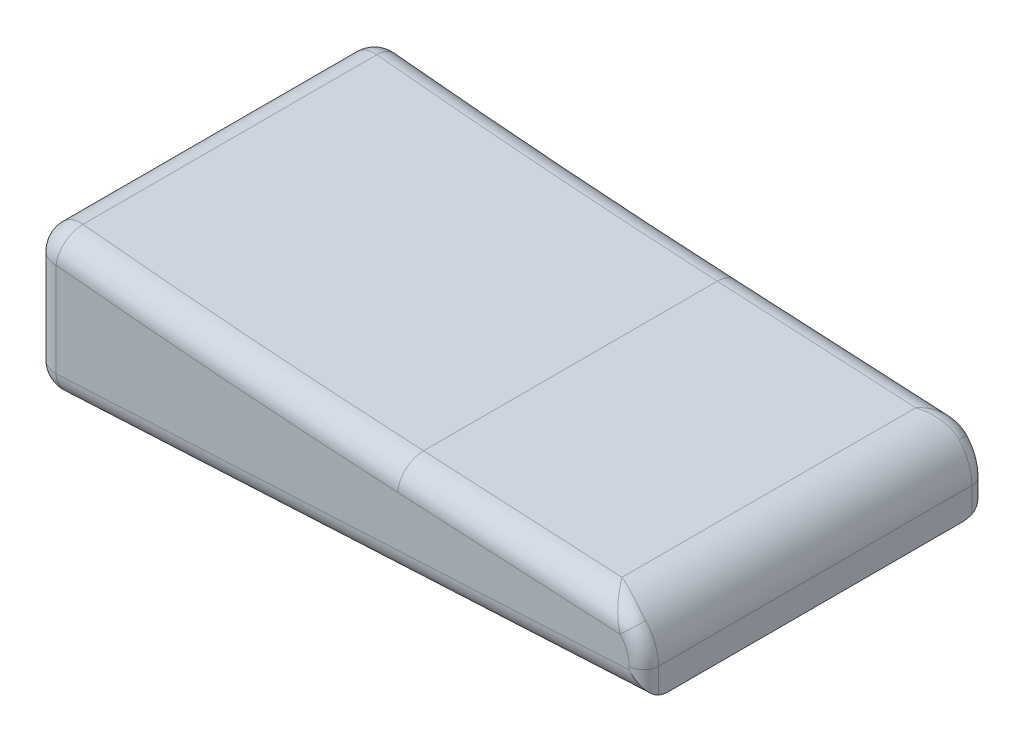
ISO-10303-21;
HEADER;
FILE_DESCRIPTION(('STEP AP214'),'2;1');
FILE_NAME('part.step','',(''),(''),'','','');
FILE_SCHEMA(('AUTOMOTIVE_DESIGN { 1 0 10303 214 1 1 1 1 }'));
ENDSEC;
DATA;
#1=APPLICATION_CONTEXT('core data for automotive mechanical design processes');
#2=APPLICATION_PROTOCOL_DEFINITION('international standard','automotive_design',2000,#1);
#3=PRODUCT_CONTEXT('',#1,'mechanical');
#4=PRODUCT('Part','Part','',(#3));
#5=PRODUCT_RELATED_PRODUCT_CATEGORY('part','',(#4));
#6=PRODUCT_DEFINITION_FORMATION('','',#4);
#7=PRODUCT_DEFINITION_CONTEXT('part definition',#1,'design');
#8=PRODUCT_DEFINITION('design','',#6,#7);
#9=PRODUCT_DEFINITION_SHAPE('','',#8);
#10=(LENGTH_UNIT() NAMED_UNIT(*) SI_UNIT(.MILLI.,.METRE.));
#11=(NAMED_UNIT(*) PLANE_ANGLE_UNIT() SI_UNIT($,.RADIAN.));
#12=(NAMED_UNIT(*) SI_UNIT($,.STERADIAN.) SOLID_ANGLE_UNIT());
#13=UNCERTAINTY_MEASURE_WITH_UNIT(LENGTH_MEASURE(1.E-05),#10,'distance_accuracy_value','');
#14=(GEOMETRIC_REPRESENTATION_CONTEXT(3) GLOBAL_UNCERTAINTY_ASSIGNED_CONTEXT((#13)) GLOBAL_UNIT_ASSIGNED_CONTEXT((#10,
#11,#12)) REPRESENTATION_CONTEXT('',''));
#15=CARTESIAN_POINT('',(0.,0.,0.));
#16=DIRECTION('',(0.,0.,1.));
#17=DIRECTION('',(1.,0.,0.));
#18=AXIS2_PLACEMENT_3D('',#15,#16,#17);
#19=CARTESIAN_POINT('',(0.,-7.5,35.));
#20=DIRECTION('',(-0.0523359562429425,0.998629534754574,0.));
#21=DIRECTION('',(-0.998629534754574,-0.0523359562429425,0.));
#22=AXIS2_PLACEMENT_3D('',#19,#20,#21);
#23=PLANE('',#22);
#24=DIRECTION('',(0.,0.,-1.));
#25=VECTOR('',#24,1.);
#26=CARTESIAN_POINT('',(-119.797416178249,-13.7783165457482,35.));
#27=LINE('',#26,#25);
#28=CARTESIAN_POINT('',(-119.797416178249,-13.7783165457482,30.));
#29=VERTEX_POINT('',#28);
#30=CARTESIAN_POINT('',(-119.797416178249,-13.7783165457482,-30.));
#31=VERTEX_POINT('',#30);
#32=EDGE_CURVE('E469',#29,#31,#27,.T.);
#33=ORIENTED_EDGE('',*,*,#32,.T.);
#34=DIRECTION('',(0.998629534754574,0.0523359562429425,0.));
#35=VECTOR('',#34,1.);
#36=CARTESIAN_POINT('',(0.,-7.5,-30.));
#37=LINE('',#36,#35);
#38=CARTESIAN_POINT('',(0.,-7.5,-30.));
#39=VERTEX_POINT('',#38);
#40=EDGE_CURVE('E359',#31,#39,#37,.T.);
#41=ORIENTED_EDGE('',*,*,#40,.T.);
#42=DIRECTION('',(0.,0.,-1.));
#43=VECTOR('',#42,1.);
#44=CARTESIAN_POINT('',(0.,-7.5,35.));
#45=LINE('',#44,#43);
#46=CARTESIAN_POINT('',(0.,-7.5,30.));
#47=VERTEX_POINT('',#46);
#48=EDGE_CURVE('E347',#47,#39,#45,.T.);
#49=ORIENTED_EDGE('',*,*,#48,.F.);
#50=DIRECTION('',(0.998629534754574,0.0523359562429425,0.));
#51=VECTOR('',#50,1.);
#52=CARTESIAN_POINT('',(0.,-7.5,30.));
#53=LINE('',#52,#51);
#54=EDGE_CURVE('E398',#47,#29,#53,.F.);
#55=ORIENTED_EDGE('',*,*,#54,.T.);
#56=EDGE_LOOP('',(#33,#41,#49,#55));
#57=FACE_BOUND('',#56,.T.);
#58=ADVANCED_FACE('F33',(#57),#23,.F.);
#59=CARTESIAN_POINT('',(0.,7.5,35.));
#60=DIRECTION('',(-1.,0.,0.));
#61=DIRECTION('',(0.,-1.,0.));
#62=AXIS2_PLACEMENT_3D('',#59,#60,#61);
#63=PLANE('',#62);
#64=ORIENTED_EDGE('',*,*,#48,.T.);
#65=CARTESIAN_POINT('',(0.,-2.4931382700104,-30.));
#66=DIRECTION('',(-1.,0.,0.));
#67=DIRECTION('',(0.,-1.,0.));
#68=AXIS2_PLACEMENT_3D('',#65,#66,#67);
#69=ELLIPSE('',#68,5.0068617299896,5.);
#70=CARTESIAN_POINT('',(0.,-7.08200284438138,-32.));
#71=VERTEX_POINT('',#70);
#72=EDGE_CURVE('E349',#39,#71,#69,.F.);
#73=ORIENTED_EDGE('',*,*,#72,.T.);
#74=DIRECTION('',(0.,1.,0.));
#75=VECTOR('',#74,1.);
#76=CARTESIAN_POINT('',(0.,7.5,-32.));
#77=LINE('',#76,#75);
#78=CARTESIAN_POINT('',(0.,-1.9896456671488,-32.));
#79=VERTEX_POINT('',#78);
#80=EDGE_CURVE('E363',#71,#79,#77,.T.);
#81=ORIENTED_EDGE('',*,*,#80,.T.);
#82=DIRECTION('',(0.,0.,-1.));
#83=VECTOR('',#82,1.);
#84=CARTESIAN_POINT('',(0.,-1.9896456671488,35.));
#85=LINE('',#84,#83);
#86=CARTESIAN_POINT('',(0.,-1.9896456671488,32.));
#87=VERTEX_POINT('',#86);
#88=EDGE_CURVE('E163',#79,#87,#85,.F.);
#89=ORIENTED_EDGE('',*,*,#88,.T.);
#90=DIRECTION('',(0.,1.,0.));
#91=VECTOR('',#90,1.);
#92=CARTESIAN_POINT('',(0.,7.5,32.));
#93=LINE('',#92,#91);
#94=CARTESIAN_POINT('',(0.,-7.08200284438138,32.));
#95=VERTEX_POINT('',#94);
#96=EDGE_CURVE('E442',#87,#95,#93,.F.);
#97=ORIENTED_EDGE('',*,*,#96,.T.);
#98=CARTESIAN_POINT('',(0.,-2.49313827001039,30.));
#99=DIRECTION('',(-1.,0.,0.));
#100=DIRECTION('',(0.,1.,0.));
#101=AXIS2_PLACEMENT_3D('',#98,#99,#100);
#102=ELLIPSE('',#101,5.0068617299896,5.);
#103=EDGE_CURVE('E352',#95,#47,#102,.F.);
#104=ORIENTED_EDGE('',*,*,#103,.T.);
#105=EDGE_LOOP('',(#64,#73,#81,#89,#97,#104));
#106=FACE_BOUND('',#105,.T.);
#107=ADVANCED_FACE('F337',(#106),#63,.F.);
#108=CARTESIAN_POINT('',(0.,7.5,35.));
#109=DIRECTION('',(-0.0523359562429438,-0.998629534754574,0.));
#110=DIRECTION('',(0.998629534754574,-0.0523359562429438,0.));
#111=AXIS2_PLACEMENT_3D('',#108,#109,#110);
#112=PLANE('',#111);
#113=DIRECTION('',(0.,0.,-1.));
#114=VECTOR('',#113,1.);
#115=CARTESIAN_POINT('',(-9.47664043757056,7.99664968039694,35.));
#116=LINE('',#115,#114);
#117=CARTESIAN_POINT('',(-9.47664043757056,7.99664968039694,30.));
#118=VERTEX_POINT('',#117);
#119=CARTESIAN_POINT('',(-9.47664043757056,7.99664968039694,-30.));
#120=VERTEX_POINT('',#119);
#121=EDGE_CURVE('E394',#118,#120,#116,.T.);
#122=ORIENTED_EDGE('',*,*,#121,.T.);
#123=DIRECTION('',(-0.998629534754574,0.0523359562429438,0.));
#124=VECTOR('',#123,1.);
#125=CARTESIAN_POINT('',(-50.,10.1203889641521,-30.));
#126=LINE('',#125,#124);
#127=CARTESIAN_POINT('',(-50.,10.1203889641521,-30.));
#128=VERTEX_POINT('',#127);
#129=EDGE_CURVE('E396',#120,#128,#126,.T.);
#130=ORIENTED_EDGE('',*,*,#129,.T.);
#131=DIRECTION('',(0.,0.,-1.));
#132=VECTOR('',#131,1.);
#133=CARTESIAN_POINT('',(-50.,10.1203889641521,35.));
#134=LINE('',#133,#132);
#135=CARTESIAN_POINT('',(-50.,10.1203889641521,30.));
#136=VERTEX_POINT('',#135);
#137=EDGE_CURVE('E354',#136,#128,#134,.T.);
#138=ORIENTED_EDGE('',*,*,#137,.F.);
#139=DIRECTION('',(-0.998629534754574,0.0523359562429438,0.));
#140=VECTOR('',#139,1.);
#141=CARTESIAN_POINT('',(0.,7.5,30.));
#142=LINE('',#141,#140);
#143=EDGE_CURVE('E392',#136,#118,#142,.F.);
#144=ORIENTED_EDGE('',*,*,#143,.T.);
#145=EDGE_LOOP('',(#122,#130,#138,#144));
#146=FACE_BOUND('',#145,.T.);
#147=ADVANCED_FACE('F335',(#146),#112,.F.);
#148=CARTESIAN_POINT('',(28.5039343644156,1508.06469109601,35.));
#149=DIRECTION('',(0.,0.,-1.));
#150=DIRECTION('',(-1.,0.,0.));
#151=AXIS2_PLACEMENT_3D('',#148,#149,#150);
#152=CYLINDRICAL_SURFACE('',#151,1500.);
#153=ORIENTED_EDGE('',*,*,#137,.T.);
#154=CARTESIAN_POINT('',(28.5039343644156,1508.06469109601,-30.));
#155=DIRECTION('',(0.,0.,-1.));
#156=DIRECTION('',(-1.,0.,0.));
#157=AXIS2_PLACEMENT_3D('',#154,#155,#156);
#158=CIRCLE('',#157,1500.);
#159=CARTESIAN_POINT('',(-119.565531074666,15.3907704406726,-30.));
#160=VERTEX_POINT('',#159);
#161=EDGE_CURVE('E12',#128,#160,#158,.T.);
#162=ORIENTED_EDGE('',*,*,#161,.T.);
#163=DIRECTION('',(0.,0.,-1.));
#164=VECTOR('',#163,1.);
#165=CARTESIAN_POINT('',(-119.565531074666,15.3907704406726,35.));
#166=LINE('',#165,#164);
#167=CARTESIAN_POINT('',(-119.565531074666,15.3907704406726,30.));
#168=VERTEX_POINT('',#167);
#169=EDGE_CURVE('E413',#168,#160,#166,.T.);
#170=ORIENTED_EDGE('',*,*,#169,.F.);
#171=CARTESIAN_POINT('',(28.5039343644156,1508.06469109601,30.));
#172=DIRECTION('',(0.,0.,-1.));
#173=DIRECTION('',(-1.,0.,0.));
#174=AXIS2_PLACEMENT_3D('',#171,#172,#173);
#175=CIRCLE('',#174,1500.);
#176=EDGE_CURVE('E40',#168,#136,#175,.F.);
#177=ORIENTED_EDGE('',*,*,#176,.T.);
#178=EDGE_LOOP('',(#153,#162,#170,#177));
#179=FACE_BOUND('',#178,.T.);
#180=ADVANCED_FACE('F332',(#179),#152,.F.);
#181=CARTESIAN_POINT('',(-120.059095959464,10.4151907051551,35.));
#182=DIRECTION('',(0.,0.,-1.));
#183=DIRECTION('',(-1.,0.,0.));
#184=AXIS2_PLACEMENT_3D('',#181,#182,#183);
#185=CYLINDRICAL_SURFACE('',#184,4.99999999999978);
#186=ORIENTED_EDGE('',*,*,#169,.T.);
#187=CARTESIAN_POINT('',(-120.059095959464,10.4151907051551,-30.));
#188=DIRECTION('',(0.,0.,-1.));
#189=DIRECTION('',(-1.,0.,0.));
#190=AXIS2_PLACEMENT_3D('',#187,#188,#189);
#191=CIRCLE('',#190,4.99999999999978);
#192=CARTESIAN_POINT('',(-125.059095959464,10.4151907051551,-30.));
#193=VERTEX_POINT('',#192);
#194=EDGE_CURVE('E410',#160,#193,#191,.F.);
#195=ORIENTED_EDGE('',*,*,#194,.T.);
#196=DIRECTION('',(0.,0.,-1.));
#197=VECTOR('',#196,1.);
#198=CARTESIAN_POINT('',(-125.059095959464,10.4151907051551,35.));
#199=LINE('',#198,#197);
#200=CARTESIAN_POINT('',(-125.059095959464,10.4151907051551,30.));
#201=VERTEX_POINT('',#200);
#202=EDGE_CURVE('E461',#201,#193,#199,.T.);
#203=ORIENTED_EDGE('',*,*,#202,.F.);
#204=CARTESIAN_POINT('',(-120.059095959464,10.4151907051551,30.));
#205=DIRECTION('',(0.,0.,-1.));
#206=DIRECTION('',(-1.,0.,0.));
#207=AXIS2_PLACEMENT_3D('',#204,#205,#206);
#208=CIRCLE('',#207,4.99999999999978);
#209=EDGE_CURVE('E52',#201,#168,#208,.T.);
#210=ORIENTED_EDGE('',*,*,#209,.T.);
#211=EDGE_LOOP('',(#186,#195,#203,#210));
#212=FACE_BOUND('',#211,.T.);
#213=ADVANCED_FACE('F328',(#212),#185,.T.);
#214=CARTESIAN_POINT('',(-125.059095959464,-8.7851688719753,35.));
#215=DIRECTION('',(1.,0.,0.));
#216=DIRECTION('',(0.,1.,0.));
#217=AXIS2_PLACEMENT_3D('',#214,#215,#216);
#218=PLANE('',#217);
#219=ORIENTED_EDGE('',*,*,#202,.T.);
#220=DIRECTION('',(0.,-1.,0.));
#221=VECTOR('',#220,1.);
#222=CARTESIAN_POINT('',(-125.059095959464,-8.7851688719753,-30.));
#223=LINE('',#222,#221);
#224=CARTESIAN_POINT('',(-125.059095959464,-8.7851688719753,-30.));
#225=VERTEX_POINT('',#224);
#226=EDGE_CURVE('E407',#193,#225,#223,.T.);
#227=ORIENTED_EDGE('',*,*,#226,.T.);
#228=DIRECTION('',(0.,0.,-1.));
#229=VECTOR('',#228,1.);
#230=CARTESIAN_POINT('',(-125.059095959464,-8.7851688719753,35.));
#231=LINE('',#230,#229);
#232=CARTESIAN_POINT('',(-125.059095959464,-8.7851688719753,30.));
#233=VERTEX_POINT('',#232);
#234=EDGE_CURVE('E466',#233,#225,#231,.T.);
#235=ORIENTED_EDGE('',*,*,#234,.F.);
#236=DIRECTION('',(0.,-1.,0.));
#237=VECTOR('',#236,1.);
#238=CARTESIAN_POINT('',(-125.059095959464,-8.7851688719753,30.));
#239=LINE('',#238,#237);
#240=EDGE_CURVE('E405',#233,#201,#239,.F.);
#241=ORIENTED_EDGE('',*,*,#240,.T.);
#242=EDGE_LOOP('',(#219,#227,#235,#241));
#243=FACE_BOUND('',#242,.T.);
#244=ADVANCED_FACE('F324',(#243),#218,.F.);
#245=CARTESIAN_POINT('',(-120.059095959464,-8.7851688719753,35.));
#246=DIRECTION('',(0.,0.,-1.));
#247=DIRECTION('',(-1.,0.,0.));
#248=AXIS2_PLACEMENT_3D('',#245,#246,#247);
#249=CYLINDRICAL_SURFACE('',#248,5.);
#250=ORIENTED_EDGE('',*,*,#234,.T.);
#251=CARTESIAN_POINT('',(-120.059095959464,-8.7851688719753,-30.));
#252=DIRECTION('',(0.,0.,-1.));
#253=DIRECTION('',(-1.,0.,0.));
#254=AXIS2_PLACEMENT_3D('',#251,#252,#253);
#255=CIRCLE('',#254,5.);
#256=EDGE_CURVE('E403',#225,#31,#255,.F.);
#257=ORIENTED_EDGE('',*,*,#256,.T.);
#258=ORIENTED_EDGE('',*,*,#32,.F.);
#259=CARTESIAN_POINT('',(-120.059095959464,-8.7851688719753,30.));
#260=DIRECTION('',(0.,0.,-1.));
#261=DIRECTION('',(-1.,0.,0.));
#262=AXIS2_PLACEMENT_3D('',#259,#260,#261);
#263=CIRCLE('',#262,5.);
#264=EDGE_CURVE('E401',#29,#233,#263,.T.);
#265=ORIENTED_EDGE('',*,*,#264,.T.);
#266=EDGE_LOOP('',(#250,#257,#258,#265));
#267=FACE_BOUND('',#266,.T.);
#268=ADVANCED_FACE('F320',(#267),#249,.T.);
#269=CARTESIAN_POINT('',(-120.059095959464,-8.7851688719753,35.));
#270=DIRECTION('',(0.,0.,-1.));
#271=DIRECTION('',(-1.,0.,0.));
#272=AXIS2_PLACEMENT_3D('',#269,#270,#271);
#273=PLANE('',#272);
#274=DIRECTION('',(0.998629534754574,0.0523359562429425,0.));
#275=VECTOR('',#274,1.);
#276=CARTESIAN_POINT('',(-120.059095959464,-8.7851688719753,35.));
#277=LINE('',#276,#275);
#278=CARTESIAN_POINT('',(-120.059095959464,-8.7851688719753,35.));
#279=VERTEX_POINT('',#278);
#280=CARTESIAN_POINT('',(-3.,-2.65036160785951,35.));
#281=VERTEX_POINT('',#280);
#282=EDGE_CURVE('E383',#279,#281,#277,.T.);
#283=ORIENTED_EDGE('',*,*,#282,.T.);
#284=DIRECTION('',(0.,1.,0.));
#285=VECTOR('',#284,1.);
#286=CARTESIAN_POINT('',(-3.,-8.78516887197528,35.));
#287=LINE('',#286,#285);
#288=CARTESIAN_POINT('',(-3.,-1.9896456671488,35.));
#289=VERTEX_POINT('',#288);
#290=EDGE_CURVE('E389',#281,#289,#287,.T.);
#291=ORIENTED_EDGE('',*,*,#290,.T.);
#292=CARTESIAN_POINT('',(-10.,-1.9896456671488,35.));
#293=DIRECTION('',(0.,0.,-1.));
#294=DIRECTION('',(-1.,0.,0.));
#295=AXIS2_PLACEMENT_3D('',#292,#293,#294);
#296=CIRCLE('',#295,7.);
#297=CARTESIAN_POINT('',(-4.84605461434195,2.74710923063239,35.));
#298=VERTEX_POINT('',#297);
#299=EDGE_CURVE('E387',#289,#298,#296,.F.);
#300=ORIENTED_EDGE('',*,*,#299,.T.);
#301=DIRECTION('',(-0.998629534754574,0.0523359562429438,0.));
#302=VECTOR('',#301,1.);
#303=CARTESIAN_POINT('',(-119.14079575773,8.73704279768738,35.));
#304=LINE('',#303,#302);
#305=CARTESIAN_POINT('',(-50.2616797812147,5.12724129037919,35.));
#306=VERTEX_POINT('',#305);
#307=EDGE_CURVE('E385',#298,#306,#304,.T.);
#308=ORIENTED_EDGE('',*,*,#307,.T.);
#309=CARTESIAN_POINT('',(28.5039343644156,1508.06469109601,35.));
#310=DIRECTION('',(0.,0.,-1.));
#311=DIRECTION('',(-1.,0.,0.));
#312=AXIS2_PLACEMENT_3D('',#309,#310,#311);
#313=CIRCLE('',#312,1505.);
#314=CARTESIAN_POINT('',(-120.059095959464,10.4151907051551,35.));
#315=VERTEX_POINT('',#314);
#316=EDGE_CURVE('E379',#306,#315,#313,.T.);
#317=ORIENTED_EDGE('',*,*,#316,.T.);
#318=DIRECTION('',(0.,-1.,0.));
#319=VECTOR('',#318,1.);
#320=CARTESIAN_POINT('',(-120.059095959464,-8.7851688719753,35.));
#321=LINE('',#320,#319);
#322=EDGE_CURVE('E381',#315,#279,#321,.T.);
#323=ORIENTED_EDGE('',*,*,#322,.T.);
#324=EDGE_LOOP('',(#283,#291,#300,#308,#317,#323));
#325=FACE_BOUND('',#324,.T.);
#326=ADVANCED_FACE('F316',(#325),#273,.F.);
#327=CARTESIAN_POINT('',(-120.059095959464,-8.7851688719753,-35.));
#328=DIRECTION('',(0.,0.,-1.));
#329=DIRECTION('',(-1.,0.,0.));
#330=AXIS2_PLACEMENT_3D('',#327,#328,#329);
#331=PLANE('',#330);
#332=DIRECTION('',(-0.998629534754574,0.0523359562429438,0.));
#333=VECTOR('',#332,1.);
#334=CARTESIAN_POINT('',(-0.26167978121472,2.50685232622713,-35.));
#335=LINE('',#334,#333);
#336=CARTESIAN_POINT('',(-50.2616797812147,5.12724129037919,-35.));
#337=VERTEX_POINT('',#336);
#338=CARTESIAN_POINT('',(-4.84605461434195,2.74710923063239,-35.));
#339=VERTEX_POINT('',#338);
#340=EDGE_CURVE('E373',#337,#339,#335,.F.);
#341=ORIENTED_EDGE('',*,*,#340,.T.);
#342=CARTESIAN_POINT('',(-10.,-1.9896456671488,-35.));
#343=DIRECTION('',(0.,0.,-1.));
#344=DIRECTION('',(-1.,0.,0.));
#345=AXIS2_PLACEMENT_3D('',#342,#343,#344);
#346=CIRCLE('',#345,7.);
#347=CARTESIAN_POINT('',(-3.,-1.9896456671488,-35.));
#348=VERTEX_POINT('',#347);
#349=EDGE_CURVE('E170',#339,#348,#346,.T.);
#350=ORIENTED_EDGE('',*,*,#349,.T.);
#351=DIRECTION('',(0.,1.,0.));
#352=VECTOR('',#351,1.);
#353=CARTESIAN_POINT('',(-3.,-7.5,-35.));
#354=LINE('',#353,#352);
#355=CARTESIAN_POINT('',(-3.,-2.65036160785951,-35.));
#356=VERTEX_POINT('',#355);
#357=EDGE_CURVE('E375',#348,#356,#354,.F.);
#358=ORIENTED_EDGE('',*,*,#357,.T.);
#359=DIRECTION('',(0.998629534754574,0.0523359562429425,0.));
#360=VECTOR('',#359,1.);
#361=CARTESIAN_POINT('',(-120.059095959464,-8.7851688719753,-35.));
#362=LINE('',#361,#360);
#363=CARTESIAN_POINT('',(-120.059095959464,-8.7851688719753,-35.));
#364=VERTEX_POINT('',#363);
#365=EDGE_CURVE('E371',#356,#364,#362,.F.);
#366=ORIENTED_EDGE('',*,*,#365,.T.);
#367=DIRECTION('',(0.,-1.,0.));
#368=VECTOR('',#367,1.);
#369=CARTESIAN_POINT('',(-120.059095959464,10.4151907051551,-35.));
#370=LINE('',#369,#368);
#371=CARTESIAN_POINT('',(-120.059095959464,10.4151907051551,-35.));
#372=VERTEX_POINT('',#371);
#373=EDGE_CURVE('E365',#364,#372,#370,.F.);
#374=ORIENTED_EDGE('',*,*,#373,.T.);
#375=CARTESIAN_POINT('',(28.5039343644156,1508.06469109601,-35.));
#376=DIRECTION('',(0.,0.,-1.));
#377=DIRECTION('',(-1.,0.,0.));
#378=AXIS2_PLACEMENT_3D('',#375,#376,#377);
#379=CIRCLE('',#378,1505.);
#380=EDGE_CURVE('E362',#372,#337,#379,.F.);
#381=ORIENTED_EDGE('',*,*,#380,.T.);
#382=EDGE_LOOP('',(#341,#350,#358,#366,#374,#381));
#383=FACE_BOUND('',#382,.T.);
#384=ADVANCED_FACE('F312',(#383),#331,.T.);
#385=CARTESIAN_POINT('',(-120.059095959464,-8.7851688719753,30.));
#386=DIRECTION('',(0.,-1.,0.));
#387=DIRECTION('',(1.,0.,0.));
#388=AXIS2_PLACEMENT_3D('',#385,#386,#387);
#389=CYLINDRICAL_SURFACE('',#388,5.);
#390=CARTESIAN_POINT('',(-120.059095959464,10.4151907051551,30.));
#391=DIRECTION('',(0.,1.,0.));
#392=DIRECTION('',(-1.,0.,0.));
#393=AXIS2_PLACEMENT_3D('',#390,#391,#392);
#394=CIRCLE('',#393,5.);
#395=EDGE_CURVE('E477',#201,#315,#394,.T.);
#396=ORIENTED_EDGE('',*,*,#395,.F.);
#397=ORIENTED_EDGE('',*,*,#240,.F.);
#398=CARTESIAN_POINT('',(-120.059095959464,-8.7851688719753,30.));
#399=DIRECTION('',(0.,-1.,0.));
#400=DIRECTION('',(0.,0.,-1.));
#401=AXIS2_PLACEMENT_3D('',#398,#399,#400);
#402=CIRCLE('',#401,5.);
#403=EDGE_CURVE('E474',#279,#233,#402,.T.);
#404=ORIENTED_EDGE('',*,*,#403,.F.);
#405=ORIENTED_EDGE('',*,*,#322,.F.);
#406=EDGE_LOOP('',(#396,#397,#404,#405));
#407=FACE_BOUND('',#406,.T.);
#408=ADVANCED_FACE('F308',(#407),#389,.T.);
#409=CARTESIAN_POINT('',(-120.059095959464,-8.7851688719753,30.));
#410=DIRECTION('',(0.,0.,1.));
#411=DIRECTION('',(1.,0.,0.));
#412=AXIS2_PLACEMENT_3D('',#409,#410,#411);
#413=SPHERICAL_SURFACE('',#412,5.);
#414=ORIENTED_EDGE('',*,*,#403,.T.);
#415=ORIENTED_EDGE('',*,*,#264,.F.);
#416=CARTESIAN_POINT('',(-120.059095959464,-8.7851688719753,30.));
#417=DIRECTION('',(0.998629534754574,0.0523359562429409,0.));
#418=DIRECTION('',(-0.0523359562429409,0.998629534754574,0.));
#419=AXIS2_PLACEMENT_3D('',#416,#417,#418);
#420=CIRCLE('',#419,5.);
#421=EDGE_CURVE('E479',#279,#29,#420,.T.);
#422=ORIENTED_EDGE('',*,*,#421,.F.);
#423=EDGE_LOOP('',(#414,#415,#422));
#424=FACE_BOUND('',#423,.T.);
#425=ADVANCED_FACE('F304',(#424),#413,.T.);
#426=CARTESIAN_POINT('',(-120.059095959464,10.4151907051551,30.));
#427=DIRECTION('',(0.,0.,1.));
#428=DIRECTION('',(1.,0.,0.));
#429=AXIS2_PLACEMENT_3D('',#426,#427,#428);
#430=SPHERICAL_SURFACE('',#429,5.);
#431=ORIENTED_EDGE('',*,*,#209,.F.);
#432=ORIENTED_EDGE('',*,*,#395,.T.);
#433=CARTESIAN_POINT('',(-120.059095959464,10.4151907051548,30.));
#434=DIRECTION('',(0.995115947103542,-0.0987129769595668,0.));
#435=DIRECTION('',(0.0987129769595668,0.995115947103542,0.));
#436=AXIS2_PLACEMENT_3D('',#433,#434,#435);
#437=CIRCLE('',#436,5.);
#438=EDGE_CURVE('E283',#168,#315,#437,.T.);
#439=ORIENTED_EDGE('',*,*,#438,.F.);
#440=EDGE_LOOP('',(#431,#432,#439));
#441=FACE_BOUND('',#440,.T.);
#442=ADVANCED_FACE('F301',(#441),#430,.T.);
#443=CARTESIAN_POINT('',(-120.059095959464,-8.7851688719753,30.));
#444=DIRECTION('',(0.998629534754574,0.0523359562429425,0.));
#445=DIRECTION('',(-0.0523359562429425,0.998629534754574,0.));
#446=AXIS2_PLACEMENT_3D('',#443,#444,#445);
#447=CYLINDRICAL_SURFACE('',#446,5.);
#448=ORIENTED_EDGE('',*,*,#54,.F.);
#449=ORIENTED_EDGE('',*,*,#103,.F.);
#450=CARTESIAN_POINT('',(0.,-7.08200284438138,32.));
#451=CARTESIAN_POINT('',(1.07206284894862E-05,-7.04283874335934,32.0896685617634));
#452=CARTESIAN_POINT('',(-0.00401847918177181,-7.00120053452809,32.1781946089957));
#453=CARTESIAN_POINT('',(-0.0194688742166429,-6.91345635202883,32.3521794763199));
#454=CARTESIAN_POINT('',(-0.0308788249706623,-6.86735726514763,32.4376427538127));
#455=CARTESIAN_POINT('',(-0.0602645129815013,-6.77151482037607,32.6041890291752));
#456=CARTESIAN_POINT('',(-0.0781758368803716,-6.7218109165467,32.6853063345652));
#457=CARTESIAN_POINT('',(-0.119905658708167,-6.6187794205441,32.8436611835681));
#458=CARTESIAN_POINT('',(-0.143726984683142,-6.565450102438,32.9208968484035));
#459=CARTESIAN_POINT('',(-0.203092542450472,-6.44215130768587,33.0895582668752));
#460=CARTESIAN_POINT('',(-0.240078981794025,-6.3713015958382,33.1798357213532));
#461=CARTESIAN_POINT('',(-0.321024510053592,-6.22536758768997,33.3536213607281));
#462=CARTESIAN_POINT('',(-0.364988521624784,-6.1502803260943,33.4371247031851));
#463=CARTESIAN_POINT('',(-0.506113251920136,-5.91908002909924,33.6778607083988));
#464=CARTESIAN_POINT('',(-0.612280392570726,-5.75747846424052,33.8247130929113));
#465=CARTESIAN_POINT('',(-0.805080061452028,-5.47723281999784,34.0485915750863));
#466=CARTESIAN_POINT('',(-0.88725104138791,-5.36119220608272,34.1330026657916));
#467=CARTESIAN_POINT('',(-1.0578970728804,-5.12535308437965,34.2894600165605));
#468=CARTESIAN_POINT('',(-1.14637441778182,-5.00555321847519,34.3615017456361));
#469=CARTESIAN_POINT('',(-1.32824412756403,-4.76305297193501,34.4935662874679));
#470=CARTESIAN_POINT('',(-1.42163845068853,-4.64035144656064,34.5535842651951));
#471=CARTESIAN_POINT('',(-1.61216437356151,-4.39279193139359,34.6619381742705));
#472=CARTESIAN_POINT('',(-1.70929541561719,-4.26793426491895,34.7102758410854));
#473=CARTESIAN_POINT('',(-1.99842642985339,-3.89916727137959,34.8354934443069));
#474=CARTESIAN_POINT('',(-2.19432989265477,-3.65294609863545,34.8968847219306));
#475=CARTESIAN_POINT('',(-2.59059234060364,-3.15819439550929,34.9787927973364));
#476=CARTESIAN_POINT('',(-2.7909411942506,-2.90966974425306,34.9993944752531));
#477=CARTESIAN_POINT('',(-2.99407749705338,-2.65770763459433,34.9999956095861));
#478=CARTESIAN_POINT('',(-2.99703877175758,-2.65403459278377,34.9999999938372));
#479=CARTESIAN_POINT('',(-3.,-2.65036160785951,35.));
#480=B_SPLINE_CURVE_WITH_KNOTS('',3,(#450,#451,#452,#453,#454,#455,#456,#457,#458,#459,#460,
#461,#462,#463,#464,#465,#466,#467,#468,#469,#470,#471,#472,#473,#474,#475,#476,#477,#478,#479),
.UNSPECIFIED.,.F.,.F.,(4,2,2,2,2,2,2,2,2,2,2,2,2,2,4),(0.,0.293341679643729,0.586237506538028,
0.876307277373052,1.16651612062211,1.52768851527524,1.889116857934,2.61430913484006,
3.10983736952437,3.60554673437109,4.10145503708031,4.59728961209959,5.55606891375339,
6.5128509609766,6.52700523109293),.UNSPECIFIED.);
#481=EDGE_CURVE('E275',#281,#95,#480,.F.);
#482=ORIENTED_EDGE('',*,*,#481,.F.);
#483=ORIENTED_EDGE('',*,*,#282,.F.);
#484=ORIENTED_EDGE('',*,*,#421,.T.);
#485=EDGE_LOOP('',(#448,#449,#482,#483,#484));
#486=FACE_BOUND('',#485,.T.);
#487=ADVANCED_FACE('F285',(#486),#447,.T.);
#488=CARTESIAN_POINT('',(28.5039343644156,1508.06469109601,30.));
#489=DIRECTION('',(0.,0.,-1.));
#490=DIRECTION('',(-1.,0.,0.));
#491=AXIS2_PLACEMENT_3D('',#488,#489,#490);
#492=TOROIDAL_SURFACE('',#491,1505.,5.);
#493=ORIENTED_EDGE('',*,*,#438,.T.);
#494=ORIENTED_EDGE('',*,*,#316,.F.);
#495=CARTESIAN_POINT('',(-50.2616797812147,5.12724129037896,30.));
#496=DIRECTION('',(0.998629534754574,-0.0523359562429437,0.));
#497=DIRECTION('',(0.0523359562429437,0.998629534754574,0.));
#498=AXIS2_PLACEMENT_3D('',#495,#496,#497);
#499=CIRCLE('',#498,5.);
#500=EDGE_CURVE('E272',#136,#306,#499,.T.);
#501=ORIENTED_EDGE('',*,*,#500,.F.);
#502=ORIENTED_EDGE('',*,*,#176,.F.);
#503=EDGE_LOOP('',(#493,#494,#501,#502));
#504=FACE_BOUND('',#503,.T.);
#505=ADVANCED_FACE('F296',(#504),#492,.T.);
#506=CARTESIAN_POINT('',(-120.059095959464,10.4151907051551,-30.));
#507=DIRECTION('',(0.,0.,1.));
#508=DIRECTION('',(1.,0.,0.));
#509=AXIS2_PLACEMENT_3D('',#506,#507,#508);
#510=SPHERICAL_SURFACE('',#509,5.);
#511=CARTESIAN_POINT('',(-120.059095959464,10.4151907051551,-30.));
#512=DIRECTION('',(0.,-1.,0.));
#513=DIRECTION('',(0.,0.,-1.));
#514=AXIS2_PLACEMENT_3D('',#511,#512,#513);
#515=CIRCLE('',#514,5.);
#516=EDGE_CURVE('E266',#193,#372,#515,.T.);
#517=ORIENTED_EDGE('',*,*,#516,.F.);
#518=ORIENTED_EDGE('',*,*,#194,.F.);
#519=CARTESIAN_POINT('',(-120.059095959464,10.4151907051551,-30.));
#520=DIRECTION('',(0.995115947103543,-0.0987129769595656,0.));
#521=DIRECTION('',(0.0987129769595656,0.995115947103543,0.));
#522=AXIS2_PLACEMENT_3D('',#519,#520,#521);
#523=CIRCLE('',#522,5.);
#524=EDGE_CURVE('E269',#372,#160,#523,.T.);
#525=ORIENTED_EDGE('',*,*,#524,.F.);
#526=EDGE_LOOP('',(#517,#518,#525));
#527=FACE_BOUND('',#526,.T.);
#528=ADVANCED_FACE('F292',(#527),#510,.T.);
#529=CARTESIAN_POINT('',(-3.,-8.78516887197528,32.));
#530=DIRECTION('',(0.,1.,0.));
#531=DIRECTION('',(-1.,0.,0.));
#532=AXIS2_PLACEMENT_3D('',#529,#530,#531);
#533=CYLINDRICAL_SURFACE('',#532,3.);
#534=ORIENTED_EDGE('',*,*,#481,.T.);
#535=ORIENTED_EDGE('',*,*,#96,.F.);
#536=CARTESIAN_POINT('',(-3.,-1.9896456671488,32.));
#537=DIRECTION('',(0.,1.,0.));
#538=DIRECTION('',(-1.,0.,0.));
#539=AXIS2_PLACEMENT_3D('',#536,#537,#538);
#540=CIRCLE('',#539,3.);
#541=EDGE_CURVE('E263',#289,#87,#540,.T.);
#542=ORIENTED_EDGE('',*,*,#541,.F.);
#543=ORIENTED_EDGE('',*,*,#290,.F.);
#544=EDGE_LOOP('',(#534,#535,#542,#543));
#545=FACE_BOUND('',#544,.T.);
#546=ADVANCED_FACE('F288',(#545),#533,.T.);
#547=CARTESIAN_POINT('',(-119.14079575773,8.73704279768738,30.));
#548=DIRECTION('',(-0.998629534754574,0.0523359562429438,0.));
#549=DIRECTION('',(-0.0523359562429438,-0.998629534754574,0.));
#550=AXIS2_PLACEMENT_3D('',#547,#548,#549);
#551=CYLINDRICAL_SURFACE('',#550,5.);
#552=ORIENTED_EDGE('',*,*,#500,.T.);
#553=ORIENTED_EDGE('',*,*,#307,.F.);
#554=CARTESIAN_POINT('',(-9.47664043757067,7.99664968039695,30.));
#555=CARTESIAN_POINT('',(-9.47664043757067,7.99664968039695,30.));
#556=CARTESIAN_POINT('',(-9.47664043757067,7.99664968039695,30.));
#557=CARTESIAN_POINT('',(-9.47172813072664,7.99639222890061,30.0065733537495));
#558=CARTESIAN_POINT('',(-9.47067549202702,7.99633707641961,30.0046013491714));
#559=CARTESIAN_POINT('',(-9.46962285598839,7.99628189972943,30.0026293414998));
#560=CARTESIAN_POINT('',(-9.46681644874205,7.99612183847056,30.013146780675));
#561=CARTESIAN_POINT('',(-9.46471074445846,7.9960192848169,30.009202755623));
#562=CARTESIAN_POINT('',(-9.46260558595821,7.9959067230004,30.00525871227));
#563=CARTESIAN_POINT('',(-9.2467116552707,7.9834234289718,30.3077580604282));
#564=CARTESIAN_POINT('',(-9.197371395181,7.98154292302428,30.2154466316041));
#565=CARTESIAN_POINT('',(-9.14811805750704,7.97876044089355,30.1231032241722));
#566=CARTESIAN_POINT('',(-9.03272832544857,7.94616165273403,30.5958692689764));
#567=CARTESIAN_POINT('',(-8.93555959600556,7.95736792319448,30.4178265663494));
#568=CARTESIAN_POINT('',(-8.84126071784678,7.94779450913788,30.2383477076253));
#569=CARTESIAN_POINT('',(-8.60793576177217,7.82159138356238,31.166600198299));
#570=CARTESIAN_POINT('',(-8.41257952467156,7.88875934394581,30.8225915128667));
#571=CARTESIAN_POINT('',(-8.2298310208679,7.857289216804,30.4666400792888));
#572=CARTESIAN_POINT('',(-8.39712938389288,7.73424032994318,31.4492150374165));
#573=CARTESIAN_POINT('',(-8.14971763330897,7.84395086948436,31.0262910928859));
#574=CARTESIAN_POINT('',(-7.92526083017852,7.79772556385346,30.5796860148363));
#575=CARTESIAN_POINT('',(-7.97931298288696,7.5083344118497,32.0031273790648));
#576=CARTESIAN_POINT('',(-7.6223443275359,7.73242431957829,31.435072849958));
#577=CARTESIAN_POINT('',(-7.31924107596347,7.64938879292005,30.8012509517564));
#578=CARTESIAN_POINT('',(-7.77230896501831,7.3697048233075,32.2744077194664));
#579=CARTESIAN_POINT('',(-7.35605743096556,7.66500817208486,31.641532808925));
#580=CARTESIAN_POINT('',(-7.01779672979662,7.56057306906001,30.909763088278));
#581=CARTESIAN_POINT('',(-7.36354544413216,7.03973804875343,32.7978998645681));
#582=CARTESIAN_POINT('',(-6.81983322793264,7.50512569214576,32.0566813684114));
#583=CARTESIAN_POINT('',(-6.42002669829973,7.35293419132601,31.1191599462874));
#584=CARTESIAN_POINT('',(-7.16178201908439,6.8484415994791,33.05012621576));
#585=CARTESIAN_POINT('',(-6.54796754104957,7.41160521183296,32.2668509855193));
#586=CARTESIAN_POINT('',(-6.12369724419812,7.23413423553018,31.2200504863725));
#587=CARTESIAN_POINT('',(-6.845199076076,6.49971916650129,33.4300241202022));
#588=CARTESIAN_POINT('',(-6.11112288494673,7.23879021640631,32.6028473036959));
#589=CARTESIAN_POINT('',(-5.65655712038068,7.01986330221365,31.3720096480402));
#590=CARTESIAN_POINT('',(-6.72825808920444,6.35994761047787,33.566772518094));
#591=CARTESIAN_POINT('',(-5.94537264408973,7.16803213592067,32.7299389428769));
#592=CARTESIAN_POINT('',(-5.48351164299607,6.93442697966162,31.4267090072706));
#593=CARTESIAN_POINT('',(-6.4970549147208,6.06057500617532,33.827924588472));
#594=CARTESIAN_POINT('',(-5.61003088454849,7.01332825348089,32.9856640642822));
#595=CARTESIAN_POINT('',(-5.14035293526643,6.75229664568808,31.5311698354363));
#596=CARTESIAN_POINT('',(-6.38279202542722,5.90097922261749,33.9523315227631));
#597=CARTESIAN_POINT('',(-5.43994647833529,6.92893012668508,33.114646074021));
#598=CARTESIAN_POINT('',(-4.97023894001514,6.65560562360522,31.5809326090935));
#599=CARTESIAN_POINT('',(-6.15744659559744,5.56161412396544,34.1858931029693));
#600=CARTESIAN_POINT('',(-5.0948261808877,6.74417059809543,33.3739636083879));
#601=CARTESIAN_POINT('',(-4.63364310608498,6.45079095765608,31.6743572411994));
#602=CARTESIAN_POINT('',(-6.04636179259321,5.38185963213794,34.2950588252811));
#603=CARTESIAN_POINT('',(-4.91925194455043,6.64322256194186,33.5046505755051));
#604=CARTESIAN_POINT('',(-4.46715870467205,6.34267571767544,31.7180235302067));
#605=CARTESIAN_POINT('',(-5.82791120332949,5.00195016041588,34.4946878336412));
#606=CARTESIAN_POINT('',(-4.56170034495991,6.42140572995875,33.7666778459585));
#607=CARTESIAN_POINT('',(-4.13858015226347,6.11490652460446,31.797875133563));
#608=CARTESIAN_POINT('',(-5.72054434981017,4.80180110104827,34.5851565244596));
#609=CARTESIAN_POINT('',(-4.37913937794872,6.29975660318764,33.8983399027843));
#610=CARTESIAN_POINT('',(-3.97648474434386,5.99525592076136,31.8340626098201));
#611=CARTESIAN_POINT('',(-5.46201955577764,4.28462214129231,34.7794067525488));
#612=CARTESIAN_POINT('',(-3.91742083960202,5.96728577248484,34.2229698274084));
#613=CARTESIAN_POINT('',(-3.5846020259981,5.68692950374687,31.9117627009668));
#614=CARTESIAN_POINT('',(-5.31324582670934,3.95594616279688,34.8704120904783));
#615=CARTESIAN_POINT('',(-3.63497136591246,5.74152677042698,34.4140173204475));
#616=CARTESIAN_POINT('',(-3.35769341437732,5.49167825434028,31.9481648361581));
#617=CARTESIAN_POINT('',(-5.09963502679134,3.43338595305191,34.9576111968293));
#618=CARTESIAN_POINT('',(-3.20193983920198,5.3508231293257,34.684257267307));
#619=CARTESIAN_POINT('',(-3.02962702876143,5.18227625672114,31.9830444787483));
#620=CARTESIAN_POINT('',(-5.03013902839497,3.25462126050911,34.9784659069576));
#621=CARTESIAN_POINT('',(-3.05333208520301,5.20898330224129,34.7730551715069));
#622=CARTESIAN_POINT('',(-2.92250190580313,5.07659203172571,31.9913863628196));
#623=CARTESIAN_POINT('',(-4.89464721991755,2.88800881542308,35.0013304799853));
#624=CARTESIAN_POINT('',(-2.75066746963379,4.90194469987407,34.9426684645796));
#625=CARTESIAN_POINT('',(-2.71283680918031,4.86016873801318,32.0005321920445));
#626=CARTESIAN_POINT('',(-4.82865046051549,2.7001635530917,35.003345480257));
#627=CARTESIAN_POINT('',(-2.59643189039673,4.73609842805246,35.0232954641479));
#628=CARTESIAN_POINT('',(-2.61029559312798,4.74943105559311,32.0013381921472));
#629=CARTESIAN_POINT('',(-4.67199535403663,2.23078633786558,34.9817329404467));
#630=CARTESIAN_POINT('',(-2.21042499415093,4.29392879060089,35.2052751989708));
#631=CARTESIAN_POINT('',(-2.36584325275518,4.47309569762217,31.9926931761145));
#632=CARTESIAN_POINT('',(-4.58349174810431,1.94489171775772,34.9462471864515));
#633=CARTESIAN_POINT('',(-1.97788392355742,4.00334327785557,35.2972133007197));
#634=CARTESIAN_POINT('',(-2.22680983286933,4.30509135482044,31.978498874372));
#635=CARTESIAN_POINT('',(-4.4581079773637,1.5084640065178,34.8519587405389));
#636=CARTESIAN_POINT('',(-1.62821583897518,3.52234309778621,35.3940514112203));
#637=CARTESIAN_POINT('',(-2.02843348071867,4.04906253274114,31.9407834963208));
#638=CARTESIAN_POINT('',(-4.41737552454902,1.36104276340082,34.8134183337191));
#639=CARTESIAN_POINT('',(-1.50937420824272,3.35095375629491,35.419526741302));
#640=CARTESIAN_POINT('',(-1.96373572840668,3.96265098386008,31.925367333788));
#641=CARTESIAN_POINT('',(-4.33868476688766,1.06524294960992,34.7213258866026));
#642=CARTESIAN_POINT('',(-1.27188088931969,2.99141686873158,35.4519796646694));
#643=CARTESIAN_POINT('',(-1.83825389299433,3.78940287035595,31.8885303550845));
#644=CARTESIAN_POINT('',(-4.30073068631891,0.916863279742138,34.6677515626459));
#645=CARTESIAN_POINT('',(-1.15337439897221,2.80312420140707,35.4585419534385));
#646=CARTESIAN_POINT('',(-1.77747578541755,3.70256586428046,31.8671006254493));
#647=CARTESIAN_POINT('',(-4.26429832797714,0.76881131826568,34.6061296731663));
#648=CARTESIAN_POINT('',(-1.03706970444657,2.60875260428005,35.4533860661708));
#649=CARTESIAN_POINT('',(-1.71888267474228,3.61598505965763,31.8424518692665));
#650=(BOUNDED_SURFACE() B_SPLINE_SURFACE(3,2,((#554,#555,#556),(#557,#558,#559),(#560,#561,
#562),(#563,#564,#565),(#566,#567,#568),(#569,#570,#571),(#572,#573,#574),(#575,#576,#577),
(#578,#579,#580),(#581,#582,#583),(#584,#585,#586),(#587,#588,#589),(#590,#591,#592),(#593,#594,
#595),(#596,#597,#598),(#599,#600,#601),(#602,#603,#604),(#605,#606,#607),(#608,#609,#610),
(#611,#612,#613),(#614,#615,#616),(#617,#618,#619),(#620,#621,#622),(#623,#624,#625),(#626,#627,
#628),(#629,#630,#631),(#632,#633,#634),(#635,#636,#637),(#638,#639,#640),(#641,#642,#643),
(#644,#645,#646),(#647,#648,#649)),.UNSPECIFIED.,.F.,.F.,.F.) B_SPLINE_SURFACE_WITH_KNOTS((4,2,
2,2,2,2,2,2,2,2,2,2,2,2,2,4),(3,3),(0.,0.0167332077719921,0.749953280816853,1.48379729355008,
2.21871491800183,2.95306568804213,3.3900373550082,3.82689322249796,4.2634299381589,
4.69984028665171,5.33547535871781,5.65216060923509,5.96875950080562,6.42680176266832,
6.65791328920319,6.88936920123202),(0.,1.),
.UNSPECIFIED.) GEOMETRIC_REPRESENTATION_ITEM() RATIONAL_B_SPLINE_SURFACE(((1.,1.,1.),(1.,
1.00000000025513,1.),(1.,0.999999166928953,1.),(1.,0.999924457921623,1.),(1.,0.998250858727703,
1.),(1.,0.991695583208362,1.),(1.,0.986811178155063,1.),(1.,0.973816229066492,1.),(1.,
0.965700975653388,1.),(1.,0.946252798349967,1.),(1.,0.934922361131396,1.),(1.,0.914333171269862,
1.),(1.,0.906093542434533,1.),(1.,0.888526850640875,1.),(1.,0.879200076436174,1.),(1.,
0.859514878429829,1.),(1.,0.849157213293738,1.),(1.,0.827501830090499,1.),(1.,0.816204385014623,
1.),(1.,0.787439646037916,1.),(1.,0.769510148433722,1.),(1.,0.741960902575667,1.),(1.,
0.732685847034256,1.),(1.,0.714058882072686,1.),(1.,0.704706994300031,1.),(1.,0.68194236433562,
1.),(1.,0.668581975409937,1.),(1.,0.649214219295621,1.),(1.,0.64284330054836,1.),(1.,
0.630443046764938,1.),(1.,0.624414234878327,1.),(1.,0.618612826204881,1.))) REPRESENTATION_ITEM('') SURFACE());
#651=CARTESIAN_POINT('',(-4.26429832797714,0.76881131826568,34.6061296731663));
#652=CARTESIAN_POINT('',(-4.30073068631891,0.916863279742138,34.6677515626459));
#653=CARTESIAN_POINT('',(-4.33868476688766,1.06524294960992,34.7213258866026));
#654=CARTESIAN_POINT('',(-4.41737552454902,1.36104276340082,34.8134183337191));
#655=CARTESIAN_POINT('',(-4.4581079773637,1.5084640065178,34.8519587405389));
#656=CARTESIAN_POINT('',(-4.58349174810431,1.94489171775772,34.9462471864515));
#657=CARTESIAN_POINT('',(-4.67199535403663,2.23078633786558,34.9817329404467));
#658=CARTESIAN_POINT('',(-4.82865046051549,2.7001635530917,35.003345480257));
#659=CARTESIAN_POINT('',(-4.89464721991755,2.88800881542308,35.0013304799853));
#660=CARTESIAN_POINT('',(-5.03013902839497,3.25462126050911,34.9784659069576));
#661=CARTESIAN_POINT('',(-5.09963502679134,3.43338595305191,34.9576111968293));
#662=CARTESIAN_POINT('',(-5.31324582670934,3.95594616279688,34.8704120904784));
#663=CARTESIAN_POINT('',(-5.46201955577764,4.28462214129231,34.7794067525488));
#664=CARTESIAN_POINT('',(-5.72054434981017,4.80180110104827,34.5851565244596));
#665=CARTESIAN_POINT('',(-5.82791120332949,5.00195016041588,34.4946878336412));
#666=CARTESIAN_POINT('',(-6.04636179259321,5.38185963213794,34.2950588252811));
#667=CARTESIAN_POINT('',(-6.15744659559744,5.56161412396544,34.1858931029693));
#668=CARTESIAN_POINT('',(-6.38279202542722,5.90097922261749,33.9523315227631));
#669=CARTESIAN_POINT('',(-6.4970549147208,6.06057500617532,33.827924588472));
#670=CARTESIAN_POINT('',(-6.72825808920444,6.35994761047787,33.566772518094));
#671=CARTESIAN_POINT('',(-6.845199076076,6.49971916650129,33.4300241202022));
#672=CARTESIAN_POINT('',(-7.16178201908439,6.8484415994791,33.05012621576));
#673=CARTESIAN_POINT('',(-7.36354544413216,7.03973804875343,32.7978998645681));
#674=CARTESIAN_POINT('',(-7.77230896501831,7.3697048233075,32.2744077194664));
#675=CARTESIAN_POINT('',(-7.97931298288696,7.5083344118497,32.0031273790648));
#676=CARTESIAN_POINT('',(-8.39712938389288,7.73424032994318,31.4492150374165));
#677=CARTESIAN_POINT('',(-8.60793576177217,7.82159138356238,31.166600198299));
#678=CARTESIAN_POINT('',(-9.03272832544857,7.94616165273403,30.5958692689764));
#679=CARTESIAN_POINT('',(-9.2467116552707,7.9834234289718,30.3077580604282));
#680=CARTESIAN_POINT('',(-9.46681644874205,7.99612183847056,30.013146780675));
#681=CARTESIAN_POINT('',(-9.47172813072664,7.99639222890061,30.0065733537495));
#682=CARTESIAN_POINT('',(-9.47664043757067,7.99664968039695,30.));
#683=B_SPLINE_CURVE_WITH_KNOTS('',3,(#651,#652,#653,#654,#655,#656,#657,#658,#659,#660,#661,
#662,#663,#664,#665,#666,#667,#668,#669,#670,#671,#672,#673,#674,#675,#676,#677,#678,#679,#680,
#681,#682),.UNSPECIFIED.,.F.,.F.,(4,2,2,2,2,2,2,2,2,2,2,2,2,2,2,4),(0.,0.231455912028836,
0.462567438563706,0.920609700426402,1.23720859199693,1.55389384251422,2.18952891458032,
2.62593926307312,3.06247597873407,3.49933184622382,3.93630351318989,4.67065428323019,
5.40557190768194,6.13941592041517,6.87263599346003,6.88936920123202),.UNSPECIFIED.);
#684=EDGE_CURVE('E253',#118,#298,#683,.F.);
#685=ORIENTED_EDGE('',*,*,#684,.F.);
#686=ORIENTED_EDGE('',*,*,#143,.F.);
#687=EDGE_LOOP('',(#552,#553,#685,#686));
#688=FACE_BOUND('',#687,.T.);
#689=ADVANCED_FACE('F228',(#688),#551,.T.);
#690=CARTESIAN_POINT('',(28.5039343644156,1508.06469109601,-30.));
#691=DIRECTION('',(0.,0.,-1.));
#692=DIRECTION('',(-1.,0.,0.));
#693=AXIS2_PLACEMENT_3D('',#690,#691,#692);
#694=TOROIDAL_SURFACE('',#693,1505.,5.);
#695=ORIENTED_EDGE('',*,*,#524,.T.);
#696=ORIENTED_EDGE('',*,*,#161,.F.);
#697=CARTESIAN_POINT('',(-50.2616797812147,5.12724129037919,-30.));
#698=DIRECTION('',(0.998629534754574,-0.0523359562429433,0.));
#699=DIRECTION('',(0.0523359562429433,0.998629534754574,0.));
#700=AXIS2_PLACEMENT_3D('',#697,#698,#699);
#701=CIRCLE('',#700,5.);
#702=EDGE_CURVE('E261',#337,#128,#701,.T.);
#703=ORIENTED_EDGE('',*,*,#702,.F.);
#704=ORIENTED_EDGE('',*,*,#380,.F.);
#705=EDGE_LOOP('',(#695,#696,#703,#704));
#706=FACE_BOUND('',#705,.T.);
#707=ADVANCED_FACE('F455',(#706),#694,.T.);
#708=CARTESIAN_POINT('',(-120.059095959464,-8.78516887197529,-30.));
#709=DIRECTION('',(0.,1.,0.));
#710=DIRECTION('',(-1.,0.,0.));
#711=AXIS2_PLACEMENT_3D('',#708,#709,#710);
#712=CYLINDRICAL_SURFACE('',#711,5.);
#713=ORIENTED_EDGE('',*,*,#516,.T.);
#714=ORIENTED_EDGE('',*,*,#373,.F.);
#715=CARTESIAN_POINT('',(-120.059095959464,-8.78516887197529,-30.));
#716=DIRECTION('',(0.,-1.,0.));
#717=DIRECTION('',(0.,0.,-1.));
#718=AXIS2_PLACEMENT_3D('',#715,#716,#717);
#719=CIRCLE('',#718,5.);
#720=EDGE_CURVE('E433',#225,#364,#719,.T.);
#721=ORIENTED_EDGE('',*,*,#720,.F.);
#722=ORIENTED_EDGE('',*,*,#226,.F.);
#723=EDGE_LOOP('',(#713,#714,#721,#722));
#724=FACE_BOUND('',#723,.T.);
#725=ADVANCED_FACE('F484',(#724),#712,.T.);
#726=CARTESIAN_POINT('',(-10.,-1.9896456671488,32.));
#727=DIRECTION('',(0.,0.,-1.));
#728=DIRECTION('',(-1.,0.,0.));
#729=AXIS2_PLACEMENT_3D('',#726,#727,#728);
#730=TOROIDAL_SURFACE('',#729,7.,3.);
#731=CARTESIAN_POINT('',(-4.84605461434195,2.74710923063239,32.));
#732=DIRECTION('',(-0.676679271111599,0.736277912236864,0.));
#733=DIRECTION('',(-0.736277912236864,-0.676679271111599,0.));
#734=AXIS2_PLACEMENT_3D('',#731,#732,#733);
#735=CIRCLE('',#734,3.);
#736=CARTESIAN_POINT('',(-2.63722087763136,4.77714704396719,32.));
#737=VERTEX_POINT('',#736);
#738=EDGE_CURVE('E260',#298,#737,#735,.T.);
#739=ORIENTED_EDGE('',*,*,#738,.F.);
#740=ORIENTED_EDGE('',*,*,#299,.F.);
#741=ORIENTED_EDGE('',*,*,#541,.T.);
#742=CARTESIAN_POINT('',(-10.,-1.9896456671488,32.));
#743=DIRECTION('',(0.,0.,-1.));
#744=DIRECTION('',(-1.,0.,0.));
#745=AXIS2_PLACEMENT_3D('',#742,#743,#744);
#746=CIRCLE('',#745,10.);
#747=EDGE_CURVE('E241',#737,#87,#746,.T.);
#748=ORIENTED_EDGE('',*,*,#747,.F.);
#749=EDGE_LOOP('',(#739,#740,#741,#748));
#750=FACE_BOUND('',#749,.T.);
#751=ADVANCED_FACE('F225',(#750),#730,.T.);
#752=ORIENTED_EDGE('',*,*,#684,.T.);
#753=ORIENTED_EDGE('',*,*,#738,.T.);
#754=CARTESIAN_POINT('',(-1.71888267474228,3.61598505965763,31.8424518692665));
#755=CARTESIAN_POINT('',(-1.77747578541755,3.70256586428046,31.8671006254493));
#756=CARTESIAN_POINT('',(-1.83825389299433,3.78940287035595,31.8885303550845));
#757=CARTESIAN_POINT('',(-1.96373572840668,3.96265098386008,31.925367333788));
#758=CARTESIAN_POINT('',(-2.02843348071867,4.04906253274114,31.9407834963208));
#759=CARTESIAN_POINT('',(-2.22680983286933,4.30509135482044,31.978498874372));
#760=CARTESIAN_POINT('',(-2.36584325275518,4.47309569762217,31.9926931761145));
#761=CARTESIAN_POINT('',(-2.61029559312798,4.74943105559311,32.0013381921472));
#762=CARTESIAN_POINT('',(-2.71283680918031,4.86016873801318,32.0005321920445));
#763=CARTESIAN_POINT('',(-2.92250190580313,5.07659203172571,31.9913863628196));
#764=CARTESIAN_POINT('',(-3.02962702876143,5.18227625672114,31.9830444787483));
#765=CARTESIAN_POINT('',(-3.35769341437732,5.49167825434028,31.9481648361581));
#766=CARTESIAN_POINT('',(-3.5846020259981,5.68692950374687,31.9117627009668));
#767=CARTESIAN_POINT('',(-3.97648474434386,5.99525592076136,31.8340626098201));
#768=CARTESIAN_POINT('',(-4.13858015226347,6.11490652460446,31.797875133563));
#769=CARTESIAN_POINT('',(-4.46715870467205,6.34267571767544,31.7180235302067));
#770=CARTESIAN_POINT('',(-4.63364310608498,6.45079095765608,31.6743572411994));
#771=CARTESIAN_POINT('',(-4.97023894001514,6.65560562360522,31.5809326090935));
#772=CARTESIAN_POINT('',(-5.14035293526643,6.75229664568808,31.5311698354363));
#773=CARTESIAN_POINT('',(-5.48351164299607,6.93442697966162,31.4267090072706));
#774=CARTESIAN_POINT('',(-5.65655712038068,7.01986330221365,31.3720096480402));
#775=CARTESIAN_POINT('',(-6.12369724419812,7.23413423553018,31.2200504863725));
#776=CARTESIAN_POINT('',(-6.42002669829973,7.35293419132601,31.1191599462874));
#777=CARTESIAN_POINT('',(-7.01779672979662,7.56057306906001,30.909763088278));
#778=CARTESIAN_POINT('',(-7.31924107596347,7.64938879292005,30.8012509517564));
#779=CARTESIAN_POINT('',(-7.92526083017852,7.79772556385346,30.5796860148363));
#780=CARTESIAN_POINT('',(-8.2298310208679,7.857289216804,30.4666400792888));
#781=CARTESIAN_POINT('',(-8.84126071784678,7.94779450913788,30.2383477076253));
#782=CARTESIAN_POINT('',(-9.14811805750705,7.97876044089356,30.1231032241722));
#783=CARTESIAN_POINT('',(-9.46260558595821,7.9959067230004,30.00525871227));
#784=CARTESIAN_POINT('',(-9.46962285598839,7.99628189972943,30.0026293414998));
#785=CARTESIAN_POINT('',(-9.47664043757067,7.99664968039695,30.));
#786=B_SPLINE_CURVE_WITH_KNOTS('',3,(#754,#755,#756,#757,#758,#759,#760,#761,#762,#763,#764,
#765,#766,#767,#768,#769,#770,#771,#772,#773,#774,#775,#776,#777,#778,#779,#780,#781,#782,#783,
#784,#785),.UNSPECIFIED.,.F.,.F.,(4,2,2,2,2,2,2,2,2,2,2,2,2,2,2,4),(0.,0.231455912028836,
0.462567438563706,0.920609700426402,1.23720859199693,1.55389384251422,2.18952891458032,
2.62593926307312,3.06247597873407,3.49933184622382,3.93630351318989,4.67065428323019,
5.40557190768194,6.13941592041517,6.87263599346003,6.88936920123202),.UNSPECIFIED.);
#787=EDGE_CURVE('E156',#118,#737,#786,.F.);
#788=ORIENTED_EDGE('',*,*,#787,.F.);
#789=EDGE_LOOP('',(#752,#753,#788));
#790=FACE_BOUND('',#789,.T.);
#791=ADVANCED_FACE('F204',(#790),#650,.T.);
#792=CARTESIAN_POINT('',(-0.26167978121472,2.50685232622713,-30.));
#793=DIRECTION('',(0.998629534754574,-0.0523359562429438,0.));
#794=DIRECTION('',(0.0523359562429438,0.998629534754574,0.));
#795=AXIS2_PLACEMENT_3D('',#792,#793,#794);
#796=CYLINDRICAL_SURFACE('',#795,5.);
#797=ORIENTED_EDGE('',*,*,#702,.T.);
#798=ORIENTED_EDGE('',*,*,#129,.F.);
#799=CARTESIAN_POINT('',(-9.47664043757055,7.99664968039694,-30.));
#800=CARTESIAN_POINT('',(-9.47664043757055,7.99664968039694,-30.));
#801=CARTESIAN_POINT('',(-9.47664043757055,7.99664968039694,-30.));
#802=CARTESIAN_POINT('',(-9.46962285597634,7.99628189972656,-30.0026293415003));
#803=CARTESIAN_POINT('',(-9.47067549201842,7.99633707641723,-30.0046013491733));
#804=CARTESIAN_POINT('',(-9.47172813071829,7.9963922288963,-30.0065733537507));
#805=CARTESIAN_POINT('',(-9.46260558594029,7.99590672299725,-30.0052587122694));
#806=CARTESIAN_POINT('',(-9.46471074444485,7.99601928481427,-30.009202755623));
#807=CARTESIAN_POINT('',(-9.46681644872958,7.99612183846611,-30.0131467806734));
#808=CARTESIAN_POINT('',(-9.14814030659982,7.97876165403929,-30.123094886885));
#809=CARTESIAN_POINT('',(-9.19739031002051,7.98154394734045,-30.215432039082));
#810=CARTESIAN_POINT('',(-9.24672722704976,7.98342432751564,-30.3077372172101));
#811=CARTESIAN_POINT('',(-8.84130513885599,7.94779899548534,-30.2383310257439));
#812=CARTESIAN_POINT('',(-8.93559755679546,7.95737143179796,-30.4177972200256));
#813=CARTESIAN_POINT('',(-9.03275930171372,7.946167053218,-30.5958275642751));
#814=CARTESIAN_POINT('',(-8.22991912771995,7.85730434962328,-30.4666072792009));
#815=CARTESIAN_POINT('',(-8.41265529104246,7.88877076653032,-30.8225328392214));
#816=CARTESIAN_POINT('',(-8.60799685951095,7.82161298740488,-31.166518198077));
#817=CARTESIAN_POINT('',(-7.92537045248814,7.79774805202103,-30.579645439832));
#818=CARTESIAN_POINT('',(-8.14981252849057,7.84396780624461,-31.0262175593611));
#819=CARTESIAN_POINT('',(-8.39720520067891,7.73427360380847,-31.4491135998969));
#820=CARTESIAN_POINT('',(-7.31934900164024,7.64941955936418,-30.8012119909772));
#821=CARTESIAN_POINT('',(-7.62243899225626,7.73244751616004,-31.4349994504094));
#822=CARTESIAN_POINT('',(-7.9793871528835,7.50838224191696,-32.0030299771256));
#823=CARTESIAN_POINT('',(-7.01788196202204,7.56060052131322,-30.9097328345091));
#824=CARTESIAN_POINT('',(-7.35613281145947,7.66502898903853,-31.6414743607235));
#825=CARTESIAN_POINT('',(-7.77236736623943,7.36974810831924,-32.2743320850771));
#826=CARTESIAN_POINT('',(-6.42006811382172,7.35295072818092,-31.1191458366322));
#827=CARTESIAN_POINT('',(-6.81987080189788,7.50513858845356,-32.0566523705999));
#828=CARTESIAN_POINT('',(-7.36357364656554,7.03976466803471,-32.7978645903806));
#829=CARTESIAN_POINT('',(-6.12371751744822,7.23414328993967,-31.2200438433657));
#830=CARTESIAN_POINT('',(-6.54798616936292,7.41161245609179,-32.2668368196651));
#831=CARTESIAN_POINT('',(-7.16179577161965,6.84845630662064,-33.0501096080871));
#832=CARTESIAN_POINT('',(-5.65618918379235,7.01969468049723,-31.3721293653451));
#833=CARTESIAN_POINT('',(-6.11077101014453,7.23865109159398,-32.603117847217));
#834=CARTESIAN_POINT('',(-6.84494971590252,6.49944475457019,-33.4303234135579));
#835=CARTESIAN_POINT('',(-5.48278108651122,6.93406668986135,-31.426940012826));
#836=CARTESIAN_POINT('',(-5.94466637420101,7.16773083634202,-32.730480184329));
#837=CARTESIAN_POINT('',(-6.72776437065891,6.35935822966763,-33.5673500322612));
#838=CARTESIAN_POINT('',(-5.13890945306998,6.75150290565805,-31.5316005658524));
#839=CARTESIAN_POINT('',(-5.6085975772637,7.01264184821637,-32.9867543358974));
#840=CARTESIAN_POINT('',(-6.49608388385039,6.05926745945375,-33.8290014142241));
#841=CARTESIAN_POINT('',(-4.96844512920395,6.65457019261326,-31.5814518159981));
#842=CARTESIAN_POINT('',(-5.43813717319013,6.92801765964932,-33.1160170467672));
#843=CARTESIAN_POINT('',(-6.38158801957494,5.89926863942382,-33.953629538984));
#844=CARTESIAN_POINT('',(-4.63129154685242,6.44930336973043,-31.6749883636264));
#845=CARTESIAN_POINT('',(-5.09236878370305,6.74279693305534,-33.3757980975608));
#846=CARTESIAN_POINT('',(-6.15587537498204,5.55914417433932,-34.1874709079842));
#847=CARTESIAN_POINT('',(-4.46459727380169,6.34098563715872,-31.7186823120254));
#848=CARTESIAN_POINT('',(-4.91652117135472,6.64162038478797,-33.506669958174));
#849=CARTESIAN_POINT('',(-6.04465417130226,5.37904741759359,-34.2967057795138));
#850=CARTESIAN_POINT('',(-4.13559446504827,6.11274988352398,-31.7985638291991));
#851=CARTESIAN_POINT('',(-4.55837701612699,6.41924812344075,-33.7690944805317));
#852=CARTESIAN_POINT('',(-5.82593098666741,4.99834608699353,-34.4964095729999));
#853=CARTESIAN_POINT('',(-3.97328439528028,5.9928359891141,-31.8347540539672));
#854=CARTESIAN_POINT('',(-4.37549181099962,6.29726702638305,-33.9009724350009));
#855=CARTESIAN_POINT('',(-5.71842770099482,4.79774880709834,-34.58688513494));
#856=CARTESIAN_POINT('',(-3.60625037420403,5.7038326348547,-31.9073949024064));
#857=CARTESIAN_POINT('',(-3.94381235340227,5.98610170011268,-34.2043198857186));
#858=CARTESIAN_POINT('',(-5.47630805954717,4.31296600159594,-34.7684872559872));
#859=CARTESIAN_POINT('',(-3.40333798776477,5.53075294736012,-31.9406947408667));
#860=CARTESIAN_POINT('',(-3.69284310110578,5.78742474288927,-34.3746121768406));
#861=CARTESIAN_POINT('',(-5.34318398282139,4.02170963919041,-34.8517368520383));
#862=CARTESIAN_POINT('',(-3.0100046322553,5.16656104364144,-31.986964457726));
#863=CARTESIAN_POINT('',(-3.17507965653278,5.3312081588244,-34.7034194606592));
#864=CARTESIAN_POINT('',(-5.08670532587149,3.40700635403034,-34.9674111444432));
#865=CARTESIAN_POINT('',(-2.81954330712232,4.97551253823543,-32.0000034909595));
#866=CARTESIAN_POINT('',(-2.9069479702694,5.07063253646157,-34.8618812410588));
#867=CARTESIAN_POINT('',(-4.96331888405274,3.08367295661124,-35.0000087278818));
#868=CARTESIAN_POINT('',(-2.55558624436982,4.68832914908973,-31.9999984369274));
#869=CARTESIAN_POINT('',(-2.51228625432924,4.64120779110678,-35.0639750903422));
#870=CARTESIAN_POINT('',(-4.79354968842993,2.59641325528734,-34.9999960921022));
#871=CARTESIAN_POINT('',(-2.47558328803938,4.59804435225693,-31.9973821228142));
#872=CARTESIAN_POINT('',(-2.38692967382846,4.49812370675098,-35.1236281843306));
#873=CARTESIAN_POINT('',(-4.74227212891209,2.4430648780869,-34.993455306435));
#874=CARTESIAN_POINT('',(-2.31925418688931,4.41508643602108,-31.9863193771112));
#875=CARTESIAN_POINT('',(-2.13338061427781,4.19364150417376,-35.2323934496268));
#876=CARTESIAN_POINT('',(-4.64243241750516,2.13199365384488,-34.9657984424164));
#877=CARTESIAN_POINT('',(-2.24292621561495,4.32241453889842,-31.9778758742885));
#878=CARTESIAN_POINT('',(-2.00517071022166,4.03190145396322,-35.2812599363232));
#879=CARTESIAN_POINT('',(-4.59386891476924,1.97427304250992,-34.9446896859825));
#880=CARTESIAN_POINT('',(-2.0937056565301,4.1344872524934,-31.9544333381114));
#881=CARTESIAN_POINT('',(-1.74564419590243,3.68696748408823,-35.3643875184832));
#882=CARTESIAN_POINT('',(-4.4992983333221,1.65412961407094,-34.8860833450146));
#883=CARTESIAN_POINT('',(-2.02085278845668,4.03921565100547,-31.9393725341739));
#884=CARTESIAN_POINT('',(-1.61439570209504,3.50330394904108,-35.3981223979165));
#885=CARTESIAN_POINT('',(-4.45332006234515,1.4916762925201,-34.8484313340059));
#886=CARTESIAN_POINT('',(-1.87979017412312,3.84786160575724,-31.9020465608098));
#887=CARTESIAN_POINT('',(-1.35156941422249,3.11533561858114,-35.4445225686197));
#888=CARTESIAN_POINT('',(-4.36467155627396,1.16509820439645,-34.7551163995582));
#889=CARTESIAN_POINT('',(-1.81158888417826,3.7517780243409,-31.879768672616));
#890=CARTESIAN_POINT('',(-1.2201603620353,2.91079607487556,-35.4566508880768));
#891=CARTESIAN_POINT('',(-4.3220073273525,1.00097098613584,-34.699421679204));
#892=CARTESIAN_POINT('',(-1.74605388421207,3.65591661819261,-31.8535890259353));
#893=CARTESIAN_POINT('',(-1.09127869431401,2.69861974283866,-35.4549489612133));
#894=CARTESIAN_POINT('',(-4.2812049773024,0.837085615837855,-34.6339725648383));
#895=(BOUNDED_SURFACE() B_SPLINE_SURFACE(3,2,((#799,#800,#801),(#802,#803,#804),(#805,#806,
#807),(#808,#809,#810),(#811,#812,#813),(#814,#815,#816),(#817,#818,#819),(#820,#821,#822),
(#823,#824,#825),(#826,#827,#828),(#829,#830,#831),(#832,#833,#834),(#835,#836,#837),(#838,#839,
#840),(#841,#842,#843),(#844,#845,#846),(#847,#848,#849),(#850,#851,#852),(#853,#854,#855),
(#856,#857,#858),(#859,#860,#861),(#862,#863,#864),(#865,#866,#867),(#868,#869,#870),(#871,#872,
#873),(#874,#875,#876),(#877,#878,#879),(#880,#881,#882),(#883,#884,#885),(#886,#887,#888),
(#889,#890,#891),(#892,#893,#894)),.UNSPECIFIED.,.F.,.F.,.F.) B_SPLINE_SURFACE_WITH_KNOTS((4,2,
2,2,2,2,2,2,2,2,2,2,2,2,2,4),(3,3),(0.,0.0167332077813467,0.749900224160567,1.48369168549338,
2.21866353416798,2.9530656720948,3.39096023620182,3.8287357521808,4.26588993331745,
4.70288911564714,5.27041204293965,5.83599359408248,6.08923200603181,6.34234323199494,
6.59786911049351,6.85384777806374),(0.,1.),
.UNSPECIFIED.) GEOMETRIC_REPRESENTATION_ITEM() RATIONAL_B_SPLINE_SURFACE(((1.,1.,1.),(1.,
1.00000000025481,1.),(1.,0.999999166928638,1.),(1.,0.999924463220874,1.),(1.,0.998251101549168,
1.),(1.,0.991696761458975,1.),(1.,0.986813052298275,1.),(1.,0.973819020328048,1.),(1.,
0.965703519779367,1.),(1.,0.946254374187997,1.),(1.,0.934923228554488,1.),(1.,0.914316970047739,
1.),(1.,0.906058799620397,1.),(1.,0.888450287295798,1.),(1.,0.879100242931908,1.),(1.,
0.859372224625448,1.),(1.,0.848995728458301,1.),(1.,0.827297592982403,1.),(1.,0.815976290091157,
1.),(1.,0.78901971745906,1.),(1.,0.773105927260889,1.),(1.,0.740480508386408,1.),(1.,
0.723771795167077,1.),(1.,0.699645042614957,1.),(1.,0.692192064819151,1.),(1.,0.677412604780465,
1.),(1.,0.670086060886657,1.),(1.,0.65561179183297,1.),(1.,0.648466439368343,1.),(1.,
0.634558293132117,1.),(1.,0.627796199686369,1.),(1.,0.621303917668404,1.))) REPRESENTATION_ITEM('') SURFACE());
#896=CARTESIAN_POINT('',(-4.2812049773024,0.837085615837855,-34.6339725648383));
#897=CARTESIAN_POINT('',(-4.3220073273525,1.00097098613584,-34.699421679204));
#898=CARTESIAN_POINT('',(-4.36467155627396,1.16509820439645,-34.7551163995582));
#899=CARTESIAN_POINT('',(-4.45332006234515,1.4916762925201,-34.8484313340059));
#900=CARTESIAN_POINT('',(-4.4992983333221,1.65412961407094,-34.8860833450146));
#901=CARTESIAN_POINT('',(-4.59386891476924,1.97427304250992,-34.9446896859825));
#902=CARTESIAN_POINT('',(-4.64243241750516,2.13199365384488,-34.9657984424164));
#903=CARTESIAN_POINT('',(-4.74227212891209,2.4430648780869,-34.993455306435));
#904=CARTESIAN_POINT('',(-4.79354968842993,2.59641325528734,-34.9999960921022));
#905=CARTESIAN_POINT('',(-4.96331888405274,3.08367295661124,-35.0000087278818));
#906=CARTESIAN_POINT('',(-5.08670532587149,3.40700635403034,-34.9674111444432));
#907=CARTESIAN_POINT('',(-5.34318398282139,4.02170963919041,-34.8517368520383));
#908=CARTESIAN_POINT('',(-5.47630805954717,4.31296600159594,-34.7684872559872));
#909=CARTESIAN_POINT('',(-5.71842770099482,4.79774880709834,-34.58688513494));
#910=CARTESIAN_POINT('',(-5.82593098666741,4.99834608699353,-34.4964095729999));
#911=CARTESIAN_POINT('',(-6.04465417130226,5.37904741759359,-34.2967057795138));
#912=CARTESIAN_POINT('',(-6.15587537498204,5.55914417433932,-34.1874709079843));
#913=CARTESIAN_POINT('',(-6.38158801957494,5.89926863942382,-33.953629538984));
#914=CARTESIAN_POINT('',(-6.49608388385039,6.05926745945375,-33.8290014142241));
#915=CARTESIAN_POINT('',(-6.72776437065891,6.35935822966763,-33.5673500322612));
#916=CARTESIAN_POINT('',(-6.84494971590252,6.49944475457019,-33.4303234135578));
#917=CARTESIAN_POINT('',(-7.16179577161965,6.84845630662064,-33.0501096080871));
#918=CARTESIAN_POINT('',(-7.36357364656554,7.03976466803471,-32.7978645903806));
#919=CARTESIAN_POINT('',(-7.77236736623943,7.36974810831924,-32.2743320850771));
#920=CARTESIAN_POINT('',(-7.97938715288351,7.50838224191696,-32.0030299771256));
#921=CARTESIAN_POINT('',(-8.39720520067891,7.73427360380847,-31.4491135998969));
#922=CARTESIAN_POINT('',(-8.60799685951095,7.82161298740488,-31.1665181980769));
#923=CARTESIAN_POINT('',(-9.03275930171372,7.946167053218,-30.5958275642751));
#924=CARTESIAN_POINT('',(-9.24672722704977,7.98342432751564,-30.3077372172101));
#925=CARTESIAN_POINT('',(-9.46681644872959,7.99612183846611,-30.0131467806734));
#926=CARTESIAN_POINT('',(-9.47172813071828,7.9963922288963,-30.0065733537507));
#927=CARTESIAN_POINT('',(-9.47664043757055,7.99664968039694,-30.));
#928=B_SPLINE_CURVE_WITH_KNOTS('',3,(#896,#897,#898,#899,#900,#901,#902,#903,#904,#905,#906,
#907,#908,#909,#910,#911,#912,#913,#914,#915,#916,#917,#918,#919,#920,#921,#922,#923,#924,#925,
#926,#927),.UNSPECIFIED.,.F.,.F.,(4,2,2,2,2,2,2,2,2,2,2,2,2,2,2,4),(0.,0.255978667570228,
0.511504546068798,0.764615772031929,1.01785418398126,1.58343573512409,2.1509586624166,
2.58795784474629,3.02511202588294,3.46288754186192,3.90078210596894,4.63518424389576,
5.37015609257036,6.10394755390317,6.83711457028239,6.85384777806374),.UNSPECIFIED.);
#929=EDGE_CURVE('E153',#339,#120,#928,.T.);
#930=ORIENTED_EDGE('',*,*,#929,.F.);
#931=ORIENTED_EDGE('',*,*,#340,.F.);
#932=EDGE_LOOP('',(#797,#798,#930,#931));
#933=FACE_BOUND('',#932,.T.);
#934=ADVANCED_FACE('F199',(#933),#796,.T.);
#935=CARTESIAN_POINT('',(-120.059095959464,-8.7851688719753,-30.));
#936=DIRECTION('',(0.,0.,1.));
#937=DIRECTION('',(1.,0.,0.));
#938=AXIS2_PLACEMENT_3D('',#935,#936,#937);
#939=SPHERICAL_SURFACE('',#938,5.);
#940=ORIENTED_EDGE('',*,*,#256,.F.);
#941=ORIENTED_EDGE('',*,*,#720,.T.);
#942=CARTESIAN_POINT('',(-120.059095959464,-8.7851688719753,-30.));
#943=DIRECTION('',(0.998629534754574,0.052335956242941,0.));
#944=DIRECTION('',(-0.052335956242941,0.998629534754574,0.));
#945=AXIS2_PLACEMENT_3D('',#942,#943,#944);
#946=CIRCLE('',#945,5.);
#947=EDGE_CURVE('E167',#31,#364,#946,.T.);
#948=ORIENTED_EDGE('',*,*,#947,.F.);
#949=EDGE_LOOP('',(#940,#941,#948));
#950=FACE_BOUND('',#949,.T.);
#951=ADVANCED_FACE('F203',(#950),#939,.T.);
#952=CARTESIAN_POINT('',(-10.,-1.9896456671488,35.));
#953=DIRECTION('',(0.,0.,-1.));
#954=DIRECTION('',(-1.,0.,0.));
#955=AXIS2_PLACEMENT_3D('',#952,#953,#954);
#956=CYLINDRICAL_SURFACE('',#955,10.);
#957=CARTESIAN_POINT('',(-1.74605388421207,3.65591661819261,-31.8535890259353));
#958=CARTESIAN_POINT('',(-1.81158888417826,3.7517780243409,-31.879768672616));
#959=CARTESIAN_POINT('',(-1.87979017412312,3.84786160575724,-31.9020465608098));
#960=CARTESIAN_POINT('',(-2.02085278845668,4.03921565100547,-31.9393725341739));
#961=CARTESIAN_POINT('',(-2.0937056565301,4.1344872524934,-31.9544333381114));
#962=CARTESIAN_POINT('',(-2.24292621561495,4.32241453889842,-31.9778758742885));
#963=CARTESIAN_POINT('',(-2.31925418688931,4.41508643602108,-31.9863193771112));
#964=CARTESIAN_POINT('',(-2.47558328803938,4.59804435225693,-31.9973821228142));
#965=CARTESIAN_POINT('',(-2.55558624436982,4.68832914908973,-31.9999984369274));
#966=CARTESIAN_POINT('',(-2.81954330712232,4.97551253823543,-32.0000034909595));
#967=CARTESIAN_POINT('',(-3.0100046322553,5.16656104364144,-31.986964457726));
#968=CARTESIAN_POINT('',(-3.40333798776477,5.53075294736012,-31.9406947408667));
#969=CARTESIAN_POINT('',(-3.60625037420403,5.7038326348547,-31.9073949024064));
#970=CARTESIAN_POINT('',(-3.97328439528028,5.9928359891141,-31.8347540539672));
#971=CARTESIAN_POINT('',(-4.13559446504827,6.11274988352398,-31.7985638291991));
#972=CARTESIAN_POINT('',(-4.46459727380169,6.34098563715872,-31.7186823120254));
#973=CARTESIAN_POINT('',(-4.63129154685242,6.44930336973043,-31.6749883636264));
#974=CARTESIAN_POINT('',(-4.96844512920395,6.65457019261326,-31.5814518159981));
#975=CARTESIAN_POINT('',(-5.13890945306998,6.75150290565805,-31.5316005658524));
#976=CARTESIAN_POINT('',(-5.48278108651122,6.93406668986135,-31.426940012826));
#977=CARTESIAN_POINT('',(-5.65618918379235,7.01969468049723,-31.3721293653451));
#978=CARTESIAN_POINT('',(-6.12371751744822,7.23414328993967,-31.2200438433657));
#979=CARTESIAN_POINT('',(-6.42006811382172,7.35295072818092,-31.1191458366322));
#980=CARTESIAN_POINT('',(-7.01788196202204,7.56060052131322,-30.9097328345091));
#981=CARTESIAN_POINT('',(-7.31934900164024,7.64941955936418,-30.8012119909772));
#982=CARTESIAN_POINT('',(-7.92537045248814,7.79774805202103,-30.579645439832));
#983=CARTESIAN_POINT('',(-8.22991912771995,7.85730434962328,-30.4666072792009));
#984=CARTESIAN_POINT('',(-8.84130513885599,7.94779899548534,-30.2383310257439));
#985=CARTESIAN_POINT('',(-9.14814030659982,7.97876165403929,-30.1230948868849));
#986=CARTESIAN_POINT('',(-9.46260558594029,7.99590672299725,-30.0052587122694));
#987=CARTESIAN_POINT('',(-9.46962285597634,7.99628189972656,-30.0026293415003));
#988=CARTESIAN_POINT('',(-9.47664043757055,7.99664968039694,-30.));
#989=B_SPLINE_CURVE_WITH_KNOTS('',3,(#957,#958,#959,#960,#961,#962,#963,#964,#965,#966,#967,
#968,#969,#970,#971,#972,#973,#974,#975,#976,#977,#978,#979,#980,#981,#982,#983,#984,#985,#986,
#987,#988),.UNSPECIFIED.,.F.,.F.,(4,2,2,2,2,2,2,2,2,2,2,2,2,2,2,4),(0.,0.255978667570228,
0.511504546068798,0.764615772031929,1.01785418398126,1.58343573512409,2.1509586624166,
2.58795784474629,3.02511202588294,3.46288754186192,3.90078210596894,4.63518424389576,
5.37015609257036,6.10394755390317,6.83711457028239,6.85384777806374),.UNSPECIFIED.);
#990=CARTESIAN_POINT('',(-2.63722087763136,4.77714704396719,-32.));
#991=VERTEX_POINT('',#990);
#992=EDGE_CURVE('E146',#120,#991,#989,.F.);
#993=ORIENTED_EDGE('',*,*,#992,.F.);
#994=ORIENTED_EDGE('',*,*,#121,.F.);
#995=ORIENTED_EDGE('',*,*,#787,.T.);
#996=ORIENTED_EDGE('',*,*,#747,.T.);
#997=ORIENTED_EDGE('',*,*,#88,.F.);
#998=CARTESIAN_POINT('',(-10.,-1.9896456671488,-32.));
#999=DIRECTION('',(0.,0.,-1.));
#1000=DIRECTION('',(-1.,0.,0.));
#1001=AXIS2_PLACEMENT_3D('',#998,#999,#1000);
#1002=CIRCLE('',#1001,10.);
#1003=EDGE_CURVE('E160',#991,#79,#1002,.T.);
#1004=ORIENTED_EDGE('',*,*,#1003,.F.);
#1005=EDGE_LOOP('',(#993,#994,#995,#996,#997,#1004));
#1006=FACE_BOUND('',#1005,.T.);
#1007=ADVANCED_FACE('F161',(#1006),#956,.T.);
#1008=ORIENTED_EDGE('',*,*,#929,.T.);
#1009=ORIENTED_EDGE('',*,*,#992,.T.);
#1010=CARTESIAN_POINT('',(-4.84605461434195,2.74710923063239,-32.));
#1011=DIRECTION('',(-0.676679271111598,0.736277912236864,0.));
#1012=DIRECTION('',(-0.736277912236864,-0.676679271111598,0.));
#1013=AXIS2_PLACEMENT_3D('',#1010,#1011,#1012);
#1014=CIRCLE('',#1013,3.);
#1015=EDGE_CURVE('E150',#339,#991,#1014,.F.);
#1016=ORIENTED_EDGE('',*,*,#1015,.F.);
#1017=EDGE_LOOP('',(#1008,#1009,#1016));
#1018=FACE_BOUND('',#1017,.T.);
#1019=ADVANCED_FACE('F148',(#1018),#895,.T.);
#1020=CARTESIAN_POINT('',(-0.261679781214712,-2.50685232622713,-30.));
#1021=DIRECTION('',(-0.998629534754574,-0.0523359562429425,0.));
#1022=DIRECTION('',(0.0523359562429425,-0.998629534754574,0.));
#1023=AXIS2_PLACEMENT_3D('',#1020,#1021,#1022);
#1024=CYLINDRICAL_SURFACE('',#1023,5.);
#1025=ORIENTED_EDGE('',*,*,#947,.T.);
#1026=ORIENTED_EDGE('',*,*,#365,.F.);
#1027=CARTESIAN_POINT('',(0.,-7.08200284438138,-32.));
#1028=CARTESIAN_POINT('',(1.07206284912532E-05,-7.04283874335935,-32.0896685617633));
#1029=CARTESIAN_POINT('',(-0.00401847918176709,-7.00120053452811,-32.1781946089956));
#1030=CARTESIAN_POINT('',(-0.0194688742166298,-6.91345635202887,-32.3521794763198));
#1031=CARTESIAN_POINT('',(-0.0308788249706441,-6.86735726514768,-32.4376427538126));
#1032=CARTESIAN_POINT('',(-0.0602645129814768,-6.77151482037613,-32.6041890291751));
#1033=CARTESIAN_POINT('',(-0.0781758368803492,-6.72181091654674,-32.6853063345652));
#1034=CARTESIAN_POINT('',(-0.119905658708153,-6.61877942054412,-32.8436611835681));
#1035=CARTESIAN_POINT('',(-0.143726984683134,-6.56545010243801,-32.9208968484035));
#1036=CARTESIAN_POINT('',(-0.203092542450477,-6.44215130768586,-33.0895582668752));
#1037=CARTESIAN_POINT('',(-0.240078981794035,-6.37130159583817,-33.1798357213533));
#1038=CARTESIAN_POINT('',(-0.321024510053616,-6.22536758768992,-33.3536213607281));
#1039=CARTESIAN_POINT('',(-0.364988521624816,-6.15028032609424,-33.4371247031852));
#1040=CARTESIAN_POINT('',(-0.506113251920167,-5.91908002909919,-33.6778607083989));
#1041=CARTESIAN_POINT('',(-0.612280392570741,-5.75747846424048,-33.8247130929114));
#1042=CARTESIAN_POINT('',(-0.805080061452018,-5.47723281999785,-34.0485915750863));
#1043=CARTESIAN_POINT('',(-0.88725104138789,-5.36119220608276,-34.1330026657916));
#1044=CARTESIAN_POINT('',(-1.05789707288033,-5.12535308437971,-34.2894600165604));
#1045=CARTESIAN_POINT('',(-1.14637441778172,-5.00555321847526,-34.361501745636));
#1046=CARTESIAN_POINT('',(-1.32824412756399,-4.76305297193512,-34.4935662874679));
#1047=CARTESIAN_POINT('',(-1.42163845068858,-4.64035144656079,-34.5535842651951));
#1048=CARTESIAN_POINT('',(-1.61216437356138,-4.39279193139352,-34.6619381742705));
#1049=CARTESIAN_POINT('',(-1.70929541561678,-4.26793426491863,-34.7102758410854));
#1050=CARTESIAN_POINT('',(-1.99842642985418,-3.89916727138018,-34.8354934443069));
#1051=CARTESIAN_POINT('',(-2.19432989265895,-3.65294609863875,-34.8968847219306));
#1052=CARTESIAN_POINT('',(-2.59059234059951,-3.1581943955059,-34.9787927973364));
#1053=CARTESIAN_POINT('',(-2.79094119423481,-2.9096697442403,-34.9993944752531));
#1054=CARTESIAN_POINT('',(-2.99407749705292,-2.65770763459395,-34.9999956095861));
#1055=CARTESIAN_POINT('',(-2.99703877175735,-2.65403459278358,-34.9999999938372));
#1056=CARTESIAN_POINT('',(-3.,-2.65036160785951,-35.));
#1057=B_SPLINE_CURVE_WITH_KNOTS('',3,(#1027,#1028,#1029,#1030,#1031,#1032,#1033,#1034,#1035,
#1036,#1037,#1038,#1039,#1040,#1041,#1042,#1043,#1044,#1045,#1046,#1047,#1048,#1049,#1050,#1051,
#1052,#1053,#1054,#1055,#1056),.UNSPECIFIED.,.F.,.F.,(4,2,2,2,2,2,2,2,2,2,2,2,2,2,4),(0.,
0.29334167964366,0.586237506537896,0.87630727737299,1.16651612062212,1.52768851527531,
1.88911685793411,2.61430913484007,3.10983736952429,3.60554673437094,4.10145503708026,
4.59728961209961,5.55606891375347,6.51285096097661,6.52700523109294),.UNSPECIFIED.);
#1058=EDGE_CURVE('E171',#71,#356,#1057,.T.);
#1059=ORIENTED_EDGE('',*,*,#1058,.F.);
#1060=ORIENTED_EDGE('',*,*,#72,.F.);
#1061=ORIENTED_EDGE('',*,*,#40,.F.);
#1062=EDGE_LOOP('',(#1025,#1026,#1059,#1060,#1061));
#1063=FACE_BOUND('',#1062,.T.);
#1064=ADVANCED_FACE('F358',(#1063),#1024,.T.);
#1065=CARTESIAN_POINT('',(-10.,-1.9896456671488,-32.));
#1066=DIRECTION('',(0.,0.,-1.));
#1067=DIRECTION('',(-1.,0.,0.));
#1068=AXIS2_PLACEMENT_3D('',#1065,#1066,#1067);
#1069=TOROIDAL_SURFACE('',#1068,7.,3.);
#1070=ORIENTED_EDGE('',*,*,#1015,.T.);
#1071=ORIENTED_EDGE('',*,*,#1003,.T.);
#1072=CARTESIAN_POINT('',(-3.,-1.9896456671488,-32.));
#1073=DIRECTION('',(0.,-1.,0.));
#1074=DIRECTION('',(1.,0.,0.));
#1075=AXIS2_PLACEMENT_3D('',#1072,#1073,#1074);
#1076=CIRCLE('',#1075,3.);
#1077=EDGE_CURVE('E173',#348,#79,#1076,.T.);
#1078=ORIENTED_EDGE('',*,*,#1077,.F.);
#1079=ORIENTED_EDGE('',*,*,#349,.F.);
#1080=EDGE_LOOP('',(#1070,#1071,#1078,#1079));
#1081=FACE_BOUND('',#1080,.T.);
#1082=ADVANCED_FACE('F169',(#1081),#1069,.T.);
#1083=CARTESIAN_POINT('',(-3.,7.5,-32.));
#1084=DIRECTION('',(0.,-1.,0.));
#1085=DIRECTION('',(1.,0.,0.));
#1086=AXIS2_PLACEMENT_3D('',#1083,#1084,#1085);
#1087=CYLINDRICAL_SURFACE('',#1086,3.);
#1088=ORIENTED_EDGE('',*,*,#1058,.T.);
#1089=ORIENTED_EDGE('',*,*,#357,.F.);
#1090=ORIENTED_EDGE('',*,*,#1077,.T.);
#1091=ORIENTED_EDGE('',*,*,#80,.F.);
#1092=EDGE_LOOP('',(#1088,#1089,#1090,#1091));
#1093=FACE_BOUND('',#1092,.T.);
#1094=ADVANCED_FACE('F452',(#1093),#1087,.T.);
#1095=CLOSED_SHELL('',(#58,#107,#147,#180,#213,#244,#268,#326,#384,#408,#425,#442,#487,#505,
#528,#546,#689,#707,#725,#751,#791,#934,#951,#1007,#1019,#1064,#1082,#1094));
#1096=MANIFOLD_SOLID_BREP('B2',#1095);
#1097=ADVANCED_BREP_SHAPE_REPRESENTATION('',(#18,#1096),#14);
#1098=SHAPE_DEFINITION_REPRESENTATION(#9,#1097);
ENDSEC;
END-ISO-10303-21;
